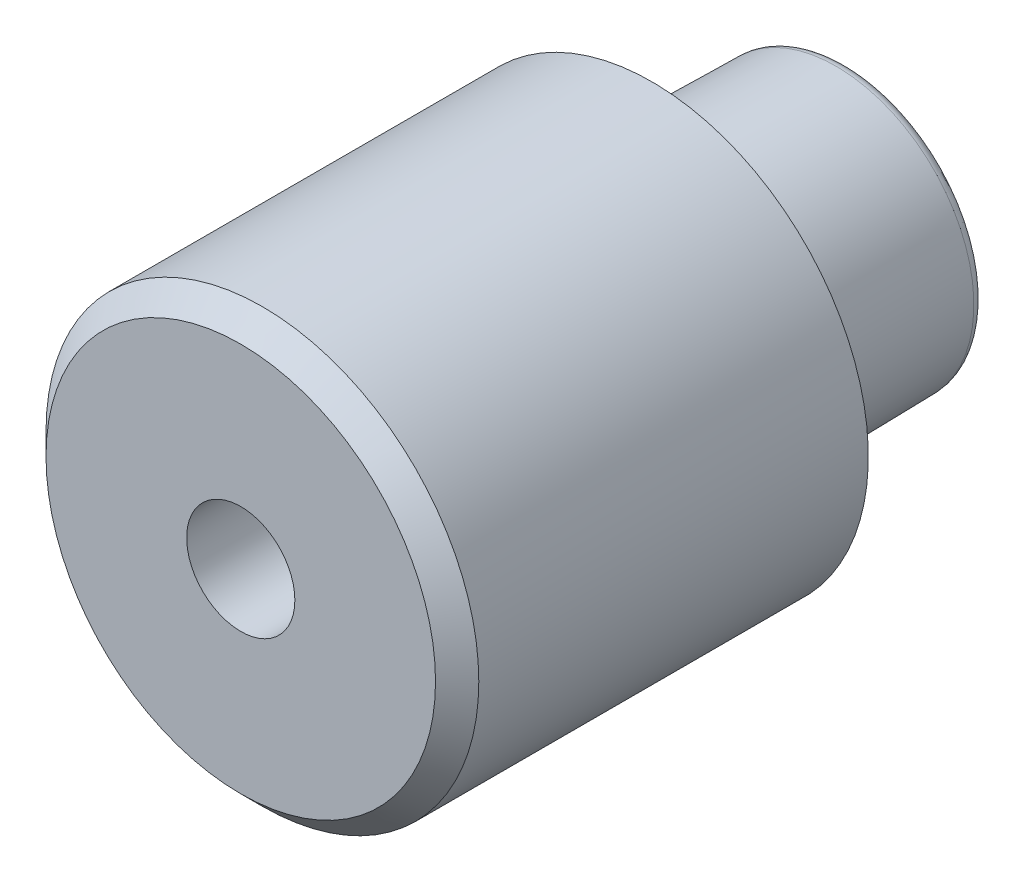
ISO-10303-21;
HEADER;
FILE_DESCRIPTION(('STEP AP214'),'2;1');
FILE_NAME('part.step','',(''),(''),'','','');
FILE_SCHEMA(('AUTOMOTIVE_DESIGN { 1 0 10303 214 1 1 1 1 }'));
ENDSEC;
DATA;
#1=APPLICATION_CONTEXT('core data for automotive mechanical design processes');
#2=APPLICATION_PROTOCOL_DEFINITION('international standard','automotive_design',2000,#1);
#3=PRODUCT_CONTEXT('',#1,'mechanical');
#4=PRODUCT('Part','Part','',(#3));
#5=PRODUCT_RELATED_PRODUCT_CATEGORY('part','',(#4));
#6=PRODUCT_DEFINITION_FORMATION('','',#4);
#7=PRODUCT_DEFINITION_CONTEXT('part definition',#1,'design');
#8=PRODUCT_DEFINITION('design','',#6,#7);
#9=PRODUCT_DEFINITION_SHAPE('','',#8);
#10=(LENGTH_UNIT() NAMED_UNIT(*) SI_UNIT(.MILLI.,.METRE.));
#11=(NAMED_UNIT(*) PLANE_ANGLE_UNIT() SI_UNIT($,.RADIAN.));
#12=(NAMED_UNIT(*) SI_UNIT($,.STERADIAN.) SOLID_ANGLE_UNIT());
#13=UNCERTAINTY_MEASURE_WITH_UNIT(LENGTH_MEASURE(1.E-05),#10,'distance_accuracy_value','');
#14=(GEOMETRIC_REPRESENTATION_CONTEXT(3) GLOBAL_UNCERTAINTY_ASSIGNED_CONTEXT((#13)) GLOBAL_UNIT_ASSIGNED_CONTEXT((#10,
#11,#12)) REPRESENTATION_CONTEXT('',''));
#15=CARTESIAN_POINT('',(0.,0.,0.));
#16=DIRECTION('',(0.,0.,1.));
#17=DIRECTION('',(1.,0.,0.));
#18=AXIS2_PLACEMENT_3D('',#15,#16,#17);
#19=CARTESIAN_POINT('',(1.03751912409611E-13,0.,14.857864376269));
#20=DIRECTION('',(0.,0.,-1.));
#21=DIRECTION('',(1.,0.,0.));
#22=AXIS2_PLACEMENT_3D('',#19,#20,#21);
#23=CONICAL_SURFACE('',#22,14.1421356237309,0.785398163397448);
#24=CARTESIAN_POINT('',(1.39659253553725E-13,0.,20.));
#25=DIRECTION('',(0.,0.,-1.));
#26=DIRECTION('',(-1.,0.,0.));
#27=AXIS2_PLACEMENT_3D('',#24,#25,#26);
#28=CIRCLE('',#27,9.);
#29=CARTESIAN_POINT('',(-8.99999999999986,0.,20.));
#30=VERTEX_POINT('',#29);
#31=CARTESIAN_POINT('',(9.00000000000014,0.,20.));
#32=VERTEX_POINT('',#31);
#33=EDGE_CURVE('E59',#30,#32,#28,.T.);
#34=ORIENTED_EDGE('',*,*,#33,.T.);
#35=CARTESIAN_POINT('',(9.00000161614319,0.,19.9999983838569));
#36=CARTESIAN_POINT('',(10.0000008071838,0.,18.9999991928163));
#37=B_SPLINE_CURVE_WITH_KNOTS('',1,(#35,#36),.UNSPECIFIED.,.F.,.F.,(2,2),(0.636396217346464,
0.707106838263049),.UNSPECIFIED.);
#38=CARTESIAN_POINT('',(10.0000000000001,0.,19.));
#39=VERTEX_POINT('',#38);
#40=EDGE_CURVE('E46',#32,#39,#37,.T.);
#41=ORIENTED_EDGE('',*,*,#40,.T.);
#42=CARTESIAN_POINT('',(1.32676290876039E-13,0.,19.));
#43=DIRECTION('',(0.,0.,1.));
#44=DIRECTION('',(-1.,0.,0.));
#45=AXIS2_PLACEMENT_3D('',#42,#43,#44);
#46=CIRCLE('',#45,10.);
#47=CARTESIAN_POINT('',(-9.99999999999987,0.,19.));
#48=VERTEX_POINT('',#47);
#49=EDGE_CURVE('E97',#39,#48,#46,.T.);
#50=ORIENTED_EDGE('',*,*,#49,.T.);
#51=CARTESIAN_POINT('',(1.32676290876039E-13,0.,19.));
#52=DIRECTION('',(0.,0.,1.));
#53=DIRECTION('',(-1.,0.,0.));
#54=AXIS2_PLACEMENT_3D('',#51,#52,#53);
#55=CIRCLE('',#54,10.);
#56=EDGE_CURVE('E11',#48,#39,#55,.T.);
#57=ORIENTED_EDGE('',*,*,#56,.T.);
#58=ORIENTED_EDGE('',*,*,#40,.F.);
#59=CARTESIAN_POINT('',(1.39659253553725E-13,0.,20.));
#60=DIRECTION('',(0.,0.,-1.));
#61=DIRECTION('',(-1.,0.,0.));
#62=AXIS2_PLACEMENT_3D('',#59,#60,#61);
#63=CIRCLE('',#62,9.);
#64=EDGE_CURVE('E94',#32,#30,#63,.T.);
#65=ORIENTED_EDGE('',*,*,#64,.T.);
#66=EDGE_LOOP('',(#34,#41,#50,#57,#58,#65));
#67=FACE_BOUND('',#66,.T.);
#68=ADVANCED_FACE('F38',(#67),#23,.T.);
#69=CARTESIAN_POINT('',(0.,0.,10.5));
#70=DIRECTION('',(0.,0.,-1.));
#71=DIRECTION('',(-1.,0.,0.));
#72=AXIS2_PLACEMENT_3D('',#69,#70,#71);
#73=CYLINDRICAL_SURFACE('',#72,10.);
#74=ORIENTED_EDGE('',*,*,#49,.F.);
#75=ORIENTED_EDGE('',*,*,#56,.F.);
#76=CARTESIAN_POINT('',(-9.99999999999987,0.,18.9999986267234));
#77=CARTESIAN_POINT('',(-10.,0.,0.999998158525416));
#78=B_SPLINE_CURVE_WITH_KNOTS('',1,(#76,#77),.UNSPECIFIED.,.F.,.F.,(2,2),(0.0833333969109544,
0.916666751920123),.UNSPECIFIED.);
#79=CARTESIAN_POINT('',(-10.,0.,1.00000000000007));
#80=VERTEX_POINT('',#79);
#81=EDGE_CURVE('E132',#48,#80,#78,.T.);
#82=ORIENTED_EDGE('',*,*,#81,.T.);
#83=CARTESIAN_POINT('',(0.,0.,1.));
#84=DIRECTION('',(0.,0.,-1.));
#85=DIRECTION('',(-1.,0.,0.));
#86=AXIS2_PLACEMENT_3D('',#83,#84,#85);
#87=CIRCLE('',#86,10.);
#88=EDGE_CURVE('E137',#80,#80,#87,.T.);
#89=ORIENTED_EDGE('',*,*,#88,.F.);
#90=ORIENTED_EDGE('',*,*,#81,.F.);
#91=EDGE_LOOP('',(#74,#75,#82,#89,#90));
#92=FACE_BOUND('',#91,.T.);
#93=ADVANCED_FACE('F182',(#92),#73,.T.);
#94=CARTESIAN_POINT('',(-11.6999999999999,-18.7061487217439,20.));
#95=DIRECTION('',(0.,0.,1.));
#96=DIRECTION('',(1.,0.,0.));
#97=AXIS2_PLACEMENT_3D('',#94,#95,#96);
#98=PLANE('',#97);
#99=CARTESIAN_POINT('',(0.,0.,19.9999999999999));
#100=DIRECTION('',(0.,0.,1.));
#101=DIRECTION('',(1.,0.,0.));
#102=AXIS2_PLACEMENT_3D('',#99,#100,#101);
#103=CIRCLE('',#102,2.49999999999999);
#104=CARTESIAN_POINT('',(2.49999999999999,0.,19.9999999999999));
#105=VERTEX_POINT('',#104);
#106=EDGE_CURVE('E95',#105,#105,#103,.T.);
#107=ORIENTED_EDGE('',*,*,#106,.F.);
#108=EDGE_LOOP('',(#107));
#109=FACE_BOUND('',#108,.T.);
#110=ORIENTED_EDGE('',*,*,#64,.F.);
#111=ORIENTED_EDGE('',*,*,#33,.F.);
#112=EDGE_LOOP('',(#110,#111));
#113=FACE_BOUND('',#112,.T.);
#114=ADVANCED_FACE('F185',(#109,#113),#98,.T.);
#115=CARTESIAN_POINT('',(0.,0.,-7.5));
#116=DIRECTION('',(0.,0.,-1.));
#117=DIRECTION('',(-1.,0.,0.));
#118=AXIS2_PLACEMENT_3D('',#115,#116,#117);
#119=TOROIDAL_SURFACE('',#118,5.86901084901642,0.5);
#120=CARTESIAN_POINT('',(0.,0.,-7.50872620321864));
#121=DIRECTION('',(0.,0.,-1.));
#122=DIRECTION('',(-1.,0.,0.));
#123=AXIS2_PLACEMENT_3D('',#120,#121,#122);
#124=CIRCLE('',#123,6.36893469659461);
#125=CARTESIAN_POINT('',(-6.36893469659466,0.,-7.5087262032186));
#126=VERTEX_POINT('',#125);
#127=EDGE_CURVE('E138',#126,#126,#124,.T.);
#128=ORIENTED_EDGE('',*,*,#127,.T.);
#129=CARTESIAN_POINT('',(-6.36893469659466,0.,-7.5087262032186));
#130=CARTESIAN_POINT('',(-6.36035948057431,0.,-7.99999999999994));
#131=CARTESIAN_POINT('',(-5.86901084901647,0.,-8.));
#132=(BOUNDED_CURVE() B_SPLINE_CURVE(2,(#129,#130,#131),.UNSPECIFIED.,.F.,
.F.) B_SPLINE_CURVE_WITH_KNOTS((3,3),(0.,0.5),
.UNSPECIFIED.) CURVE() GEOMETRIC_REPRESENTATION_ITEM() RATIONAL_B_SPLINE_CURVE((1.,
0.713250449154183,1.)) REPRESENTATION_ITEM(''));
#133=CARTESIAN_POINT('',(-5.86901084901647,0.,-8.));
#134=VERTEX_POINT('',#133);
#135=EDGE_CURVE('E121',#126,#134,#132,.T.);
#136=ORIENTED_EDGE('',*,*,#135,.T.);
#137=CARTESIAN_POINT('',(0.,0.,-8.));
#138=DIRECTION('',(0.,0.,1.));
#139=DIRECTION('',(-1.,0.,0.));
#140=AXIS2_PLACEMENT_3D('',#137,#138,#139);
#141=CIRCLE('',#140,5.86901084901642);
#142=EDGE_CURVE('E127',#134,#134,#141,.T.);
#143=ORIENTED_EDGE('',*,*,#142,.T.);
#144=ORIENTED_EDGE('',*,*,#135,.F.);
#145=EDGE_LOOP('',(#128,#136,#143,#144));
#146=FACE_BOUND('',#145,.T.);
#147=ADVANCED_FACE('F187',(#146),#119,.T.);
#148=CARTESIAN_POINT('',(0.,0.,0.));
#149=DIRECTION('',(0.,0.,1.));
#150=DIRECTION('',(-1.,0.,0.));
#151=AXIS2_PLACEMENT_3D('',#148,#149,#150);
#152=CONICAL_SURFACE('',#151,6.5,0.0174532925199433);
#153=ORIENTED_EDGE('',*,*,#127,.F.);
#154=CARTESIAN_POINT('',(-6.36893469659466,0.,-7.50872620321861));
#155=CARTESIAN_POINT('',(-6.5,0.,0.));
#156=B_SPLINE_CURVE_WITH_KNOTS('',1,(#154,#155),.UNSPECIFIED.,.F.,.F.,(2,2),(0.,1.),.UNSPECIFIED.);
#157=CARTESIAN_POINT('',(-6.5,0.,0.));
#158=VERTEX_POINT('',#157);
#159=EDGE_CURVE('E110',#126,#158,#156,.T.);
#160=ORIENTED_EDGE('',*,*,#159,.T.);
#161=CARTESIAN_POINT('',(0.,0.,0.));
#162=DIRECTION('',(0.,0.,-1.));
#163=DIRECTION('',(-1.,0.,0.));
#164=AXIS2_PLACEMENT_3D('',#161,#162,#163);
#165=CIRCLE('',#164,6.5);
#166=EDGE_CURVE('E116',#158,#158,#165,.T.);
#167=ORIENTED_EDGE('',*,*,#166,.T.);
#168=ORIENTED_EDGE('',*,*,#159,.F.);
#169=EDGE_LOOP('',(#153,#160,#167,#168));
#170=FACE_BOUND('',#169,.T.);
#171=ADVANCED_FACE('F194',(#170),#152,.T.);
#172=CARTESIAN_POINT('',(13.4987249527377,-12.1985099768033,-8.00000000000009));
#173=DIRECTION('',(0.,0.,-1.));
#174=DIRECTION('',(-1.,0.,0.));
#175=AXIS2_PLACEMENT_3D('',#172,#173,#174);
#176=PLANE('',#175);
#177=ORIENTED_EDGE('',*,*,#142,.F.);
#178=EDGE_LOOP('',(#177));
#179=FACE_BOUND('',#178,.T.);
#180=ADVANCED_FACE('F222',(#179),#176,.T.);
#181=CARTESIAN_POINT('',(0.,0.,0.5));
#182=DIRECTION('',(0.,0.,-1.));
#183=DIRECTION('',(-1.,0.,0.));
#184=AXIS2_PLACEMENT_3D('',#181,#182,#183);
#185=CYLINDRICAL_SURFACE('',#184,6.5);
#186=CARTESIAN_POINT('',(0.,0.,1.));
#187=DIRECTION('',(0.,0.,1.));
#188=DIRECTION('',(-1.,0.,0.));
#189=AXIS2_PLACEMENT_3D('',#186,#187,#188);
#190=CIRCLE('',#189,6.5);
#191=CARTESIAN_POINT('',(-6.5,0.,1.00000000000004));
#192=VERTEX_POINT('',#191);
#193=EDGE_CURVE('E105',#192,#192,#190,.T.);
#194=ORIENTED_EDGE('',*,*,#193,.F.);
#195=CARTESIAN_POINT('',(-6.5,0.,1.00000305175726));
#196=CARTESIAN_POINT('',(-6.5,0.,5.3174692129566E-07));
#197=B_SPLINE_CURVE_WITH_KNOTS('',1,(#195,#196),.UNSPECIFIED.,.F.,.F.,(2,2),(0.0833307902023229,
0.91666622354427),.UNSPECIFIED.);
#198=EDGE_CURVE('E102',#192,#158,#197,.T.);
#199=ORIENTED_EDGE('',*,*,#198,.T.);
#200=ORIENTED_EDGE('',*,*,#166,.F.);
#201=ORIENTED_EDGE('',*,*,#198,.F.);
#202=EDGE_LOOP('',(#194,#199,#200,#201));
#203=FACE_BOUND('',#202,.T.);
#204=ADVANCED_FACE('F231',(#203),#185,.T.);
#205=CARTESIAN_POINT('',(23.,-20.7846096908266,0.999999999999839));
#206=DIRECTION('',(0.,0.,-1.));
#207=DIRECTION('',(-1.,0.,0.));
#208=AXIS2_PLACEMENT_3D('',#205,#206,#207);
#209=PLANE('',#208);
#210=ORIENTED_EDGE('',*,*,#88,.T.);
#211=EDGE_LOOP('',(#210));
#212=FACE_BOUND('',#211,.T.);
#213=ORIENTED_EDGE('',*,*,#193,.T.);
#214=EDGE_LOOP('',(#213));
#215=FACE_BOUND('',#214,.T.);
#216=ADVANCED_FACE('F88',(#212,#215),#209,.T.);
#217=CARTESIAN_POINT('',(0.,0.,5.99999999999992));
#218=DIRECTION('',(0.,0.,1.));
#219=DIRECTION('',(1.,0.,0.));
#220=AXIS2_PLACEMENT_3D('',#217,#218,#219);
#221=CONICAL_SURFACE('',#220,2.5,1.02974425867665);
#222=CARTESIAN_POINT('',(0.,0.,4.49784845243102));
#223=VERTEX_POINT('',#222);
#224=VERTEX_LOOP('',#223);
#225=FACE_BOUND('',#224,.T.);
#226=CARTESIAN_POINT('',(0.,0.,5.99999999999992));
#227=DIRECTION('',(0.,0.,1.));
#228=DIRECTION('',(1.,0.,0.));
#229=AXIS2_PLACEMENT_3D('',#226,#227,#228);
#230=CIRCLE('',#229,2.5);
#231=CARTESIAN_POINT('',(2.5,0.,5.99999999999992));
#232=VERTEX_POINT('',#231);
#233=EDGE_CURVE('E92',#232,#232,#230,.T.);
#234=ORIENTED_EDGE('',*,*,#233,.T.);
#235=EDGE_LOOP('',(#234));
#236=FACE_BOUND('',#235,.T.);
#237=ADVANCED_FACE('F84',(#225,#236),#221,.F.);
#238=CARTESIAN_POINT('',(0.,0.,19.9999999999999));
#239=DIRECTION('',(0.,0.,1.));
#240=DIRECTION('',(1.,0.,0.));
#241=AXIS2_PLACEMENT_3D('',#238,#239,#240);
#242=CYLINDRICAL_SURFACE('',#241,2.49999999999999);
#243=ORIENTED_EDGE('',*,*,#233,.F.);
#244=EDGE_LOOP('',(#243));
#245=FACE_BOUND('',#244,.T.);
#246=ORIENTED_EDGE('',*,*,#106,.T.);
#247=EDGE_LOOP('',(#246));
#248=FACE_BOUND('',#247,.T.);
#249=ADVANCED_FACE('F87',(#245,#248),#242,.F.);
#250=CLOSED_SHELL('',(#68,#93,#114,#147,#171,#180,#204,#216,#237,#249));
#251=MANIFOLD_SOLID_BREP('B2',#250);
#252=ADVANCED_BREP_SHAPE_REPRESENTATION('',(#18,#251),#14);
#253=SHAPE_DEFINITION_REPRESENTATION(#9,#252);
ENDSEC;
END-ISO-10303-21;
